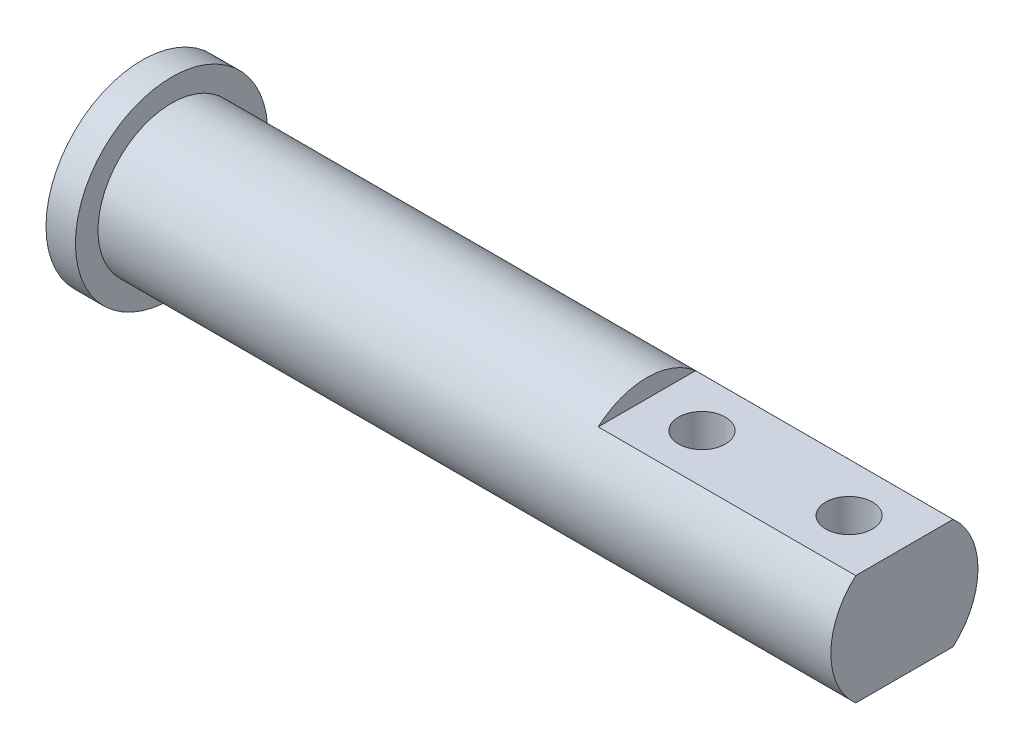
ISO-10303-21;
HEADER;
FILE_DESCRIPTION(('STEP AP214'),'2;1');
FILE_NAME('part.step','',(''),(''),'','','');
FILE_SCHEMA(('AUTOMOTIVE_DESIGN { 1 0 10303 214 1 1 1 1 }'));
ENDSEC;
DATA;
#1=APPLICATION_CONTEXT('core data for automotive mechanical design processes');
#2=APPLICATION_PROTOCOL_DEFINITION('international standard','automotive_design',2000,#1);
#3=PRODUCT_CONTEXT('',#1,'mechanical');
#4=PRODUCT('Part','Part','',(#3));
#5=PRODUCT_RELATED_PRODUCT_CATEGORY('part','',(#4));
#6=PRODUCT_DEFINITION_FORMATION('','',#4);
#7=PRODUCT_DEFINITION_CONTEXT('part definition',#1,'design');
#8=PRODUCT_DEFINITION('design','',#6,#7);
#9=PRODUCT_DEFINITION_SHAPE('','',#8);
#10=(LENGTH_UNIT() NAMED_UNIT(*) SI_UNIT(.MILLI.,.METRE.));
#11=(NAMED_UNIT(*) PLANE_ANGLE_UNIT() SI_UNIT($,.RADIAN.));
#12=(NAMED_UNIT(*) SI_UNIT($,.STERADIAN.) SOLID_ANGLE_UNIT());
#13=UNCERTAINTY_MEASURE_WITH_UNIT(LENGTH_MEASURE(1.E-05),#10,'distance_accuracy_value','');
#14=(GEOMETRIC_REPRESENTATION_CONTEXT(3) GLOBAL_UNCERTAINTY_ASSIGNED_CONTEXT((#13)) GLOBAL_UNIT_ASSIGNED_CONTEXT((#10,
#11,#12)) REPRESENTATION_CONTEXT('',''));
#15=CARTESIAN_POINT('',(0.,0.,0.));
#16=DIRECTION('',(0.,0.,1.));
#17=DIRECTION('',(1.,0.,0.));
#18=AXIS2_PLACEMENT_3D('',#15,#16,#17);
#19=CARTESIAN_POINT('',(-32.893,-0.754460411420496,0.));
#20=DIRECTION('',(1.,0.,0.));
#21=DIRECTION('',(0.,0.,-1.));
#22=AXIS2_PLACEMENT_3D('',#19,#20,#21);
#23=PLANE('',#22);
#24=CARTESIAN_POINT('',(-32.893,0.,0.));
#25=DIRECTION('',(-1.,0.,0.));
#26=DIRECTION('',(0.,0.,1.));
#27=AXIS2_PLACEMENT_3D('',#24,#25,#26);
#28=CIRCLE('',#27,8.29906452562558);
#29=CARTESIAN_POINT('',(-32.893,0.,8.29906452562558));
#30=VERTEX_POINT('',#29);
#31=EDGE_CURVE('E21',#30,#30,#28,.F.);
#32=ORIENTED_EDGE('',*,*,#31,.F.);
#33=EDGE_LOOP('',(#32));
#34=FACE_BOUND('',#33,.T.);
#35=ADVANCED_FACE('F17',(#34),#23,.F.);
#36=CARTESIAN_POINT('',(-30.353,0.,0.));
#37=DIRECTION('',(-1.,0.,0.));
#38=DIRECTION('',(0.,0.,1.));
#39=AXIS2_PLACEMENT_3D('',#36,#37,#38);
#40=CYLINDRICAL_SURFACE('',#39,8.29906452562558);
#41=ORIENTED_EDGE('',*,*,#31,.T.);
#42=EDGE_LOOP('',(#41));
#43=FACE_BOUND('',#42,.T.);
#44=CARTESIAN_POINT('',(-30.353,0.,0.));
#45=DIRECTION('',(-1.,0.,0.));
#46=DIRECTION('',(0.,0.,1.));
#47=AXIS2_PLACEMENT_3D('',#44,#45,#46);
#48=CIRCLE('',#47,8.29906452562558);
#49=CARTESIAN_POINT('',(-30.353,0.,8.29906452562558));
#50=VERTEX_POINT('',#49);
#51=EDGE_CURVE('E67',#50,#50,#48,.F.);
#52=ORIENTED_EDGE('',*,*,#51,.F.);
#53=EDGE_LOOP('',(#52));
#54=FACE_BOUND('',#53,.T.);
#55=ADVANCED_FACE('F110',(#43,#54),#40,.T.);
#56=CARTESIAN_POINT('',(-30.353,-0.754460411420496,0.));
#57=DIRECTION('',(1.,0.,0.));
#58=DIRECTION('',(0.,0.,-1.));
#59=AXIS2_PLACEMENT_3D('',#56,#57,#58);
#60=PLANE('',#59);
#61=CARTESIAN_POINT('',(-30.353,0.,0.));
#62=DIRECTION('',(1.,0.,0.));
#63=DIRECTION('',(0.,0.,-1.));
#64=AXIS2_PLACEMENT_3D('',#61,#62,#63);
#65=CIRCLE('',#64,6.35);
#66=CARTESIAN_POINT('',(-30.353,0.,-6.35));
#67=VERTEX_POINT('',#66);
#68=EDGE_CURVE('E100',#67,#67,#65,.T.);
#69=ORIENTED_EDGE('',*,*,#68,.F.);
#70=EDGE_LOOP('',(#69));
#71=FACE_BOUND('',#70,.T.);
#72=ORIENTED_EDGE('',*,*,#51,.T.);
#73=EDGE_LOOP('',(#72));
#74=FACE_BOUND('',#73,.T.);
#75=ADVANCED_FACE('F119',(#71,#74),#60,.T.);
#76=CARTESIAN_POINT('',(10.668,-5.55624999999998,0.));
#77=DIRECTION('',(1.,0.,0.));
#78=DIRECTION('',(0.,0.,-1.));
#79=AXIS2_PLACEMENT_3D('',#76,#77,#78);
#80=PLANE('',#79);
#81=DIRECTION('',(0.,0.,1.));
#82=VECTOR('',#81,1.);
#83=CARTESIAN_POINT('',(10.668,-4.76249999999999,0.));
#84=LINE('',#83,#82);
#85=CARTESIAN_POINT('',(10.668,-4.76249999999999,-4.20013020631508));
#86=VERTEX_POINT('',#85);
#87=CARTESIAN_POINT('',(10.668,-4.76249999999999,4.20013020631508));
#88=VERTEX_POINT('',#87);
#89=EDGE_CURVE('E85',#86,#88,#84,.T.);
#90=ORIENTED_EDGE('',*,*,#89,.T.);
#91=CARTESIAN_POINT('',(10.668,0.,0.));
#92=DIRECTION('',(1.,0.,0.));
#93=DIRECTION('',(0.,0.,-1.));
#94=AXIS2_PLACEMENT_3D('',#91,#92,#93);
#95=CIRCLE('',#94,6.35);
#96=EDGE_CURVE('E83',#86,#88,#95,.F.);
#97=ORIENTED_EDGE('',*,*,#96,.F.);
#98=EDGE_LOOP('',(#90,#97));
#99=FACE_BOUND('',#98,.T.);
#100=ADVANCED_FACE('F151',(#99),#80,.T.);
#101=CARTESIAN_POINT('',(32.893,0.577272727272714,0.));
#102=DIRECTION('',(1.,0.,0.));
#103=DIRECTION('',(0.,0.,-1.));
#104=AXIS2_PLACEMENT_3D('',#101,#102,#103);
#105=PLANE('',#104);
#106=DIRECTION('',(0.,0.,1.));
#107=VECTOR('',#106,1.);
#108=CARTESIAN_POINT('',(32.893,-4.76249999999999,0.));
#109=LINE('',#108,#107);
#110=CARTESIAN_POINT('',(32.893,-4.76249999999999,4.20013020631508));
#111=VERTEX_POINT('',#110);
#112=CARTESIAN_POINT('',(32.893,-4.76249999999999,-4.20013020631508));
#113=VERTEX_POINT('',#112);
#114=EDGE_CURVE('E61',#111,#113,#109,.F.);
#115=ORIENTED_EDGE('',*,*,#114,.T.);
#116=CARTESIAN_POINT('',(32.893,0.,0.));
#117=DIRECTION('',(1.,0.,0.));
#118=DIRECTION('',(0.,0.,-1.));
#119=AXIS2_PLACEMENT_3D('',#116,#117,#118);
#120=CIRCLE('',#119,6.35);
#121=CARTESIAN_POINT('',(32.893,4.76250000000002,-4.20013020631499));
#122=VERTEX_POINT('',#121);
#123=EDGE_CURVE('E66',#122,#113,#120,.F.);
#124=ORIENTED_EDGE('',*,*,#123,.F.);
#125=DIRECTION('',(0.,0.,1.));
#126=VECTOR('',#125,1.);
#127=CARTESIAN_POINT('',(32.893,4.76250000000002,0.));
#128=LINE('',#127,#126);
#129=CARTESIAN_POINT('',(32.893,4.76250000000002,4.20013020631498));
#130=VERTEX_POINT('',#129);
#131=EDGE_CURVE('E62',#130,#122,#128,.F.);
#132=ORIENTED_EDGE('',*,*,#131,.F.);
#133=CARTESIAN_POINT('',(32.893,0.,0.));
#134=DIRECTION('',(1.,0.,0.));
#135=DIRECTION('',(0.,0.,-1.));
#136=AXIS2_PLACEMENT_3D('',#133,#134,#135);
#137=CIRCLE('',#136,6.35);
#138=EDGE_CURVE('E57',#130,#111,#137,.T.);
#139=ORIENTED_EDGE('',*,*,#138,.T.);
#140=EDGE_LOOP('',(#115,#124,#132,#139));
#141=FACE_BOUND('',#140,.T.);
#142=ADVANCED_FACE('F59',(#141),#105,.T.);
#143=CARTESIAN_POINT('',(-30.353,0.,0.));
#144=DIRECTION('',(1.,0.,0.));
#145=DIRECTION('',(0.,0.,-1.));
#146=AXIS2_PLACEMENT_3D('',#143,#144,#145);
#147=CYLINDRICAL_SURFACE('',#146,6.35);
#148=DIRECTION('',(1.,0.,0.));
#149=VECTOR('',#148,1.);
#150=CARTESIAN_POINT('',(23.368,4.76250000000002,4.20013020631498));
#151=LINE('',#150,#149);
#152=CARTESIAN_POINT('',(10.668,4.76250000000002,4.20013020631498));
#153=VERTEX_POINT('',#152);
#154=EDGE_CURVE('E88',#153,#130,#151,.T.);
#155=ORIENTED_EDGE('',*,*,#154,.F.);
#156=CARTESIAN_POINT('',(10.668,0.,0.));
#157=DIRECTION('',(1.,0.,0.));
#158=DIRECTION('',(0.,0.,-1.));
#159=AXIS2_PLACEMENT_3D('',#156,#157,#158);
#160=CIRCLE('',#159,6.35);
#161=CARTESIAN_POINT('',(10.668,4.76250000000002,-4.20013020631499));
#162=VERTEX_POINT('',#161);
#163=EDGE_CURVE('E78',#162,#153,#160,.T.);
#164=ORIENTED_EDGE('',*,*,#163,.F.);
#165=DIRECTION('',(1.,0.,0.));
#166=VECTOR('',#165,1.);
#167=CARTESIAN_POINT('',(23.368,4.76250000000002,-4.20013020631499));
#168=LINE('',#167,#166);
#169=EDGE_CURVE('E36',#122,#162,#168,.F.);
#170=ORIENTED_EDGE('',*,*,#169,.F.);
#171=ORIENTED_EDGE('',*,*,#123,.T.);
#172=DIRECTION('',(1.,0.,0.));
#173=VECTOR('',#172,1.);
#174=CARTESIAN_POINT('',(23.368,-4.76249999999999,-4.20013020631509));
#175=LINE('',#174,#173);
#176=EDGE_CURVE('E77',#113,#86,#175,.F.);
#177=ORIENTED_EDGE('',*,*,#176,.T.);
#178=ORIENTED_EDGE('',*,*,#96,.T.);
#179=DIRECTION('',(1.,0.,0.));
#180=VECTOR('',#179,1.);
#181=CARTESIAN_POINT('',(23.368,-4.76249999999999,4.20013020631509));
#182=LINE('',#181,#180);
#183=EDGE_CURVE('E74',#88,#111,#182,.T.);
#184=ORIENTED_EDGE('',*,*,#183,.T.);
#185=ORIENTED_EDGE('',*,*,#138,.F.);
#186=EDGE_LOOP('',(#155,#164,#170,#171,#177,#178,#184,#185));
#187=FACE_BOUND('',#186,.T.);
#188=ORIENTED_EDGE('',*,*,#68,.T.);
#189=EDGE_LOOP('',(#188));
#190=FACE_BOUND('',#189,.T.);
#191=ADVANCED_FACE('F81',(#187,#190),#147,.T.);
#192=CARTESIAN_POINT('',(10.668,5.55625000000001,0.));
#193=DIRECTION('',(1.,0.,0.));
#194=DIRECTION('',(0.,0.,-1.));
#195=AXIS2_PLACEMENT_3D('',#192,#193,#194);
#196=PLANE('',#195);
#197=DIRECTION('',(0.,0.,1.));
#198=VECTOR('',#197,1.);
#199=CARTESIAN_POINT('',(10.668,4.76250000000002,0.));
#200=LINE('',#199,#198);
#201=EDGE_CURVE('E97',#162,#153,#200,.T.);
#202=ORIENTED_EDGE('',*,*,#201,.F.);
#203=ORIENTED_EDGE('',*,*,#163,.T.);
#204=EDGE_LOOP('',(#202,#203));
#205=FACE_BOUND('',#204,.T.);
#206=ADVANCED_FACE('F139',(#205),#196,.T.);
#207=CARTESIAN_POINT('',(15.4177999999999,-4.76249999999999,0.));
#208=DIRECTION('',(0.,1.,0.));
#209=DIRECTION('',(0.,0.,1.));
#210=AXIS2_PLACEMENT_3D('',#207,#208,#209);
#211=CYLINDRICAL_SURFACE('',#210,2.0193);
#212=CARTESIAN_POINT('',(15.4177999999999,4.76250000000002,0.));
#213=DIRECTION('',(0.,1.,0.));
#214=DIRECTION('',(0.,0.,1.));
#215=AXIS2_PLACEMENT_3D('',#212,#213,#214);
#216=CIRCLE('',#215,2.0193);
#217=CARTESIAN_POINT('',(15.4177999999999,4.76250000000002,2.0193));
#218=VERTEX_POINT('',#217);
#219=EDGE_CURVE('E95',#218,#218,#216,.F.);
#220=ORIENTED_EDGE('',*,*,#219,.F.);
#221=EDGE_LOOP('',(#220));
#222=FACE_BOUND('',#221,.T.);
#223=CARTESIAN_POINT('',(15.4177999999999,-4.76249999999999,0.));
#224=DIRECTION('',(0.,1.,0.));
#225=DIRECTION('',(0.,0.,1.));
#226=AXIS2_PLACEMENT_3D('',#223,#224,#225);
#227=CIRCLE('',#226,2.0193);
#228=CARTESIAN_POINT('',(15.4177999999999,-4.76249999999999,2.0193));
#229=VERTEX_POINT('',#228);
#230=EDGE_CURVE('E84',#229,#229,#227,.F.);
#231=ORIENTED_EDGE('',*,*,#230,.T.);
#232=EDGE_LOOP('',(#231));
#233=FACE_BOUND('',#232,.T.);
#234=ADVANCED_FACE('F133',(#222,#233),#211,.F.);
#235=CARTESIAN_POINT('',(23.368,-4.76249999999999,0.));
#236=DIRECTION('',(0.,1.,0.));
#237=DIRECTION('',(0.,0.,1.));
#238=AXIS2_PLACEMENT_3D('',#235,#236,#237);
#239=PLANE('',#238);
#240=ORIENTED_EDGE('',*,*,#230,.F.);
#241=EDGE_LOOP('',(#240));
#242=FACE_BOUND('',#241,.T.);
#243=CARTESIAN_POINT('',(28.1178,-4.76249999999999,0.));
#244=DIRECTION('',(0.,1.,0.));
#245=DIRECTION('',(0.,0.,1.));
#246=AXIS2_PLACEMENT_3D('',#243,#244,#245);
#247=CIRCLE('',#246,2.0193);
#248=CARTESIAN_POINT('',(28.1178,-4.76249999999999,2.0193));
#249=VERTEX_POINT('',#248);
#250=EDGE_CURVE('E27',#249,#249,#247,.T.);
#251=ORIENTED_EDGE('',*,*,#250,.T.);
#252=EDGE_LOOP('',(#251));
#253=FACE_BOUND('',#252,.T.);
#254=ORIENTED_EDGE('',*,*,#89,.F.);
#255=ORIENTED_EDGE('',*,*,#176,.F.);
#256=ORIENTED_EDGE('',*,*,#114,.F.);
#257=ORIENTED_EDGE('',*,*,#183,.F.);
#258=EDGE_LOOP('',(#254,#255,#256,#257));
#259=FACE_BOUND('',#258,.T.);
#260=ADVANCED_FACE('F73',(#242,#253,#259),#239,.F.);
#261=CARTESIAN_POINT('',(23.368,4.76250000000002,0.));
#262=DIRECTION('',(0.,1.,0.));
#263=DIRECTION('',(0.,0.,1.));
#264=AXIS2_PLACEMENT_3D('',#261,#262,#263);
#265=PLANE('',#264);
#266=CARTESIAN_POINT('',(28.1178,4.76250000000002,0.));
#267=DIRECTION('',(0.,1.,0.));
#268=DIRECTION('',(0.,0.,1.));
#269=AXIS2_PLACEMENT_3D('',#266,#267,#268);
#270=CIRCLE('',#269,2.0193);
#271=CARTESIAN_POINT('',(28.1178,4.76250000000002,2.0193));
#272=VERTEX_POINT('',#271);
#273=EDGE_CURVE('E11',#272,#272,#270,.F.);
#274=ORIENTED_EDGE('',*,*,#273,.T.);
#275=EDGE_LOOP('',(#274));
#276=FACE_BOUND('',#275,.T.);
#277=ORIENTED_EDGE('',*,*,#219,.T.);
#278=EDGE_LOOP('',(#277));
#279=FACE_BOUND('',#278,.T.);
#280=ORIENTED_EDGE('',*,*,#169,.T.);
#281=ORIENTED_EDGE('',*,*,#201,.T.);
#282=ORIENTED_EDGE('',*,*,#154,.T.);
#283=ORIENTED_EDGE('',*,*,#131,.T.);
#284=EDGE_LOOP('',(#280,#281,#282,#283));
#285=FACE_BOUND('',#284,.T.);
#286=ADVANCED_FACE('F122',(#276,#279,#285),#265,.T.);
#287=CARTESIAN_POINT('',(28.1178,-4.76249999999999,0.));
#288=DIRECTION('',(0.,1.,0.));
#289=DIRECTION('',(0.,0.,1.));
#290=AXIS2_PLACEMENT_3D('',#287,#288,#289);
#291=CYLINDRICAL_SURFACE('',#290,2.0193);
#292=ORIENTED_EDGE('',*,*,#273,.F.);
#293=EDGE_LOOP('',(#292));
#294=FACE_BOUND('',#293,.T.);
#295=ORIENTED_EDGE('',*,*,#250,.F.);
#296=EDGE_LOOP('',(#295));
#297=FACE_BOUND('',#296,.T.);
#298=ADVANCED_FACE('F19',(#294,#297),#291,.F.);
#299=CLOSED_SHELL('',(#35,#55,#75,#100,#142,#191,#206,#234,#260,#286,#298));
#300=MANIFOLD_SOLID_BREP('B1',#299);
#301=ADVANCED_BREP_SHAPE_REPRESENTATION('',(#18,#300),#14);
#302=SHAPE_DEFINITION_REPRESENTATION(#9,#301);
ENDSEC;
END-ISO-10303-21;
